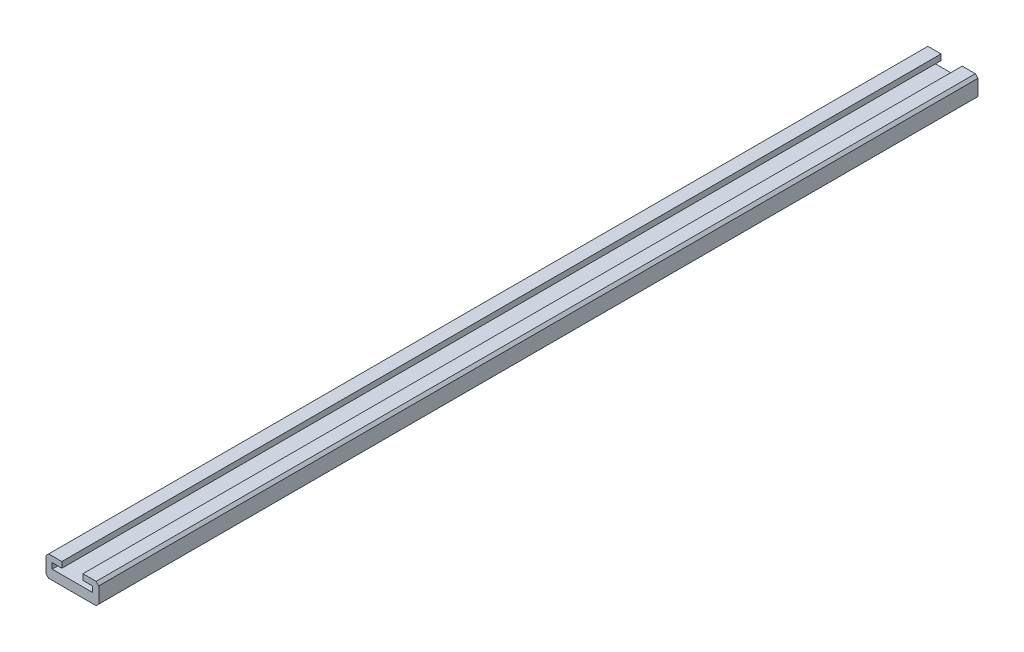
ISO-10303-21;
HEADER;
FILE_DESCRIPTION(('STEP AP214'),'2;1');
FILE_NAME('part.step','',(''),(''),'','','');
FILE_SCHEMA(('AUTOMOTIVE_DESIGN { 1 0 10303 214 1 1 1 1 }'));
ENDSEC;
DATA;
#1=APPLICATION_CONTEXT('core data for automotive mechanical design processes');
#2=APPLICATION_PROTOCOL_DEFINITION('international standard','automotive_design',2000,#1);
#3=PRODUCT_CONTEXT('',#1,'mechanical');
#4=PRODUCT('Part','Part','',(#3));
#5=PRODUCT_RELATED_PRODUCT_CATEGORY('part','',(#4));
#6=PRODUCT_DEFINITION_FORMATION('','',#4);
#7=PRODUCT_DEFINITION_CONTEXT('part definition',#1,'design');
#8=PRODUCT_DEFINITION('design','',#6,#7);
#9=PRODUCT_DEFINITION_SHAPE('','',#8);
#10=(LENGTH_UNIT() NAMED_UNIT(*) SI_UNIT(.MILLI.,.METRE.));
#11=(NAMED_UNIT(*) PLANE_ANGLE_UNIT() SI_UNIT($,.RADIAN.));
#12=(NAMED_UNIT(*) SI_UNIT($,.STERADIAN.) SOLID_ANGLE_UNIT());
#13=UNCERTAINTY_MEASURE_WITH_UNIT(LENGTH_MEASURE(1.E-05),#10,'distance_accuracy_value','');
#14=(GEOMETRIC_REPRESENTATION_CONTEXT(3) GLOBAL_UNCERTAINTY_ASSIGNED_CONTEXT((#13)) GLOBAL_UNIT_ASSIGNED_CONTEXT((#10,
#11,#12)) REPRESENTATION_CONTEXT('',''));
#15=CARTESIAN_POINT('',(0.,0.,0.));
#16=DIRECTION('',(0.,0.,1.));
#17=DIRECTION('',(1.,0.,0.));
#18=AXIS2_PLACEMENT_3D('',#15,#16,#17);
#19=CARTESIAN_POINT('',(-15.,0.,500.));
#20=DIRECTION('',(1.,0.,0.));
#21=DIRECTION('',(0.,0.,-1.));
#22=AXIS2_PLACEMENT_3D('',#19,#20,#21);
#23=PLANE('',#22);
#24=DIRECTION('',(0.,-1.,0.));
#25=VECTOR('',#24,1.);
#26=CARTESIAN_POINT('',(-15.,0.,0.));
#27=LINE('',#26,#25);
#28=CARTESIAN_POINT('',(-15.,10.5,0.));
#29=VERTEX_POINT('',#28);
#30=CARTESIAN_POINT('',(-15.,1.5,0.));
#31=VERTEX_POINT('',#30);
#32=EDGE_CURVE('E259',#29,#31,#27,.T.);
#33=ORIENTED_EDGE('',*,*,#32,.T.);
#34=DIRECTION('',(0.,0.,1.));
#35=VECTOR('',#34,1.);
#36=CARTESIAN_POINT('',(-15.,1.5,500.));
#37=LINE('',#36,#35);
#38=CARTESIAN_POINT('',(-15.,1.5,500.));
#39=VERTEX_POINT('',#38);
#40=EDGE_CURVE('E9',#31,#39,#37,.T.);
#41=ORIENTED_EDGE('',*,*,#40,.T.);
#42=DIRECTION('',(0.,-1.,0.));
#43=VECTOR('',#42,1.);
#44=CARTESIAN_POINT('',(-15.,0.,500.));
#45=LINE('',#44,#43);
#46=CARTESIAN_POINT('',(-15.,10.5,500.));
#47=VERTEX_POINT('',#46);
#48=EDGE_CURVE('E173',#47,#39,#45,.T.);
#49=ORIENTED_EDGE('',*,*,#48,.F.);
#50=DIRECTION('',(0.,0.,-1.));
#51=VECTOR('',#50,1.);
#52=CARTESIAN_POINT('',(-15.,10.5,500.));
#53=LINE('',#52,#51);
#54=EDGE_CURVE('E148',#47,#29,#53,.T.);
#55=ORIENTED_EDGE('',*,*,#54,.T.);
#56=EDGE_LOOP('',(#33,#41,#49,#55));
#57=FACE_BOUND('',#56,.T.);
#58=ADVANCED_FACE('F14',(#57),#23,.F.);
#59=CARTESIAN_POINT('',(-15.,0.,500.));
#60=DIRECTION('',(0.,1.,0.));
#61=DIRECTION('',(0.,0.,1.));
#62=AXIS2_PLACEMENT_3D('',#59,#60,#61);
#63=PLANE('',#62);
#64=DIRECTION('',(1.,0.,0.));
#65=VECTOR('',#64,1.);
#66=CARTESIAN_POINT('',(-15.,0.,0.));
#67=LINE('',#66,#65);
#68=CARTESIAN_POINT('',(-13.5,0.,0.));
#69=VERTEX_POINT('',#68);
#70=CARTESIAN_POINT('',(13.5,0.,0.));
#71=VERTEX_POINT('',#70);
#72=EDGE_CURVE('E256',#69,#71,#67,.T.);
#73=ORIENTED_EDGE('',*,*,#72,.T.);
#74=DIRECTION('',(0.,0.,1.));
#75=VECTOR('',#74,1.);
#76=CARTESIAN_POINT('',(13.5,0.,500.));
#77=LINE('',#76,#75);
#78=CARTESIAN_POINT('',(13.5,0.,500.));
#79=VERTEX_POINT('',#78);
#80=EDGE_CURVE('E34',#71,#79,#77,.T.);
#81=ORIENTED_EDGE('',*,*,#80,.T.);
#82=DIRECTION('',(1.,0.,0.));
#83=VECTOR('',#82,1.);
#84=CARTESIAN_POINT('',(-15.,0.,500.));
#85=LINE('',#84,#83);
#86=CARTESIAN_POINT('',(-13.5,0.,500.));
#87=VERTEX_POINT('',#86);
#88=EDGE_CURVE('E175',#87,#79,#85,.T.);
#89=ORIENTED_EDGE('',*,*,#88,.F.);
#90=DIRECTION('',(0.,0.,-1.));
#91=VECTOR('',#90,1.);
#92=CARTESIAN_POINT('',(-13.5,0.,500.));
#93=LINE('',#92,#91);
#94=EDGE_CURVE('E239',#87,#69,#93,.T.);
#95=ORIENTED_EDGE('',*,*,#94,.T.);
#96=EDGE_LOOP('',(#73,#81,#89,#95));
#97=FACE_BOUND('',#96,.T.);
#98=ADVANCED_FACE('F257',(#97),#63,.F.);
#99=CARTESIAN_POINT('',(15.,0.,500.));
#100=DIRECTION('',(-1.,0.,0.));
#101=DIRECTION('',(0.,0.,1.));
#102=AXIS2_PLACEMENT_3D('',#99,#100,#101);
#103=PLANE('',#102);
#104=DIRECTION('',(0.,1.,0.));
#105=VECTOR('',#104,1.);
#106=CARTESIAN_POINT('',(15.,0.,500.));
#107=LINE('',#106,#105);
#108=CARTESIAN_POINT('',(15.,1.5,500.));
#109=VERTEX_POINT('',#108);
#110=CARTESIAN_POINT('',(15.,10.5,500.));
#111=VERTEX_POINT('',#110);
#112=EDGE_CURVE('E177',#109,#111,#107,.T.);
#113=ORIENTED_EDGE('',*,*,#112,.F.);
#114=DIRECTION('',(0.,0.,-1.));
#115=VECTOR('',#114,1.);
#116=CARTESIAN_POINT('',(15.,1.5,500.));
#117=LINE('',#116,#115);
#118=CARTESIAN_POINT('',(15.,1.5,0.));
#119=VERTEX_POINT('',#118);
#120=EDGE_CURVE('E232',#109,#119,#117,.T.);
#121=ORIENTED_EDGE('',*,*,#120,.T.);
#122=DIRECTION('',(0.,1.,0.));
#123=VECTOR('',#122,1.);
#124=CARTESIAN_POINT('',(15.,0.,0.));
#125=LINE('',#124,#123);
#126=CARTESIAN_POINT('',(15.,10.5,0.));
#127=VERTEX_POINT('',#126);
#128=EDGE_CURVE('E141',#119,#127,#125,.T.);
#129=ORIENTED_EDGE('',*,*,#128,.T.);
#130=DIRECTION('',(0.,0.,1.));
#131=VECTOR('',#130,1.);
#132=CARTESIAN_POINT('',(15.,10.5,500.));
#133=LINE('',#132,#131);
#134=EDGE_CURVE('E229',#127,#111,#133,.T.);
#135=ORIENTED_EDGE('',*,*,#134,.T.);
#136=EDGE_LOOP('',(#113,#121,#129,#135));
#137=FACE_BOUND('',#136,.T.);
#138=ADVANCED_FACE('F251',(#137),#103,.F.);
#139=CARTESIAN_POINT('',(6.,12.,500.));
#140=DIRECTION('',(0.,-1.,0.));
#141=DIRECTION('',(0.,0.,-1.));
#142=AXIS2_PLACEMENT_3D('',#139,#140,#141);
#143=PLANE('',#142);
#144=DIRECTION('',(-1.,0.,0.));
#145=VECTOR('',#144,1.);
#146=CARTESIAN_POINT('',(6.,12.,500.));
#147=LINE('',#146,#145);
#148=CARTESIAN_POINT('',(13.5,12.,500.));
#149=VERTEX_POINT('',#148);
#150=CARTESIAN_POINT('',(6.,12.,500.));
#151=VERTEX_POINT('',#150);
#152=EDGE_CURVE('E179',#149,#151,#147,.T.);
#153=ORIENTED_EDGE('',*,*,#152,.F.);
#154=DIRECTION('',(0.,0.,-1.));
#155=VECTOR('',#154,1.);
#156=CARTESIAN_POINT('',(13.5,12.,500.));
#157=LINE('',#156,#155);
#158=CARTESIAN_POINT('',(13.5,12.,0.));
#159=VERTEX_POINT('',#158);
#160=EDGE_CURVE('E136',#149,#159,#157,.T.);
#161=ORIENTED_EDGE('',*,*,#160,.T.);
#162=DIRECTION('',(-1.,0.,0.));
#163=VECTOR('',#162,1.);
#164=CARTESIAN_POINT('',(6.,12.,0.));
#165=LINE('',#164,#163);
#166=CARTESIAN_POINT('',(6.,12.,0.));
#167=VERTEX_POINT('',#166);
#168=EDGE_CURVE('E129',#159,#167,#165,.T.);
#169=ORIENTED_EDGE('',*,*,#168,.T.);
#170=DIRECTION('',(0.,0.,-1.));
#171=VECTOR('',#170,1.);
#172=CARTESIAN_POINT('',(6.,12.,500.));
#173=LINE('',#172,#171);
#174=EDGE_CURVE('E133',#151,#167,#173,.T.);
#175=ORIENTED_EDGE('',*,*,#174,.F.);
#176=EDGE_LOOP('',(#153,#161,#169,#175));
#177=FACE_BOUND('',#176,.T.);
#178=ADVANCED_FACE('F132',(#177),#143,.F.);
#179=CARTESIAN_POINT('',(6.,8.7,500.));
#180=DIRECTION('',(1.,0.,0.));
#181=DIRECTION('',(0.,0.,-1.));
#182=AXIS2_PLACEMENT_3D('',#179,#180,#181);
#183=PLANE('',#182);
#184=DIRECTION('',(0.,-1.,0.));
#185=VECTOR('',#184,1.);
#186=CARTESIAN_POINT('',(6.,8.7,0.));
#187=LINE('',#186,#185);
#188=CARTESIAN_POINT('',(6.,8.7,0.));
#189=VERTEX_POINT('',#188);
#190=EDGE_CURVE('E140',#167,#189,#187,.T.);
#191=ORIENTED_EDGE('',*,*,#190,.T.);
#192=DIRECTION('',(0.,0.,-1.));
#193=VECTOR('',#192,1.);
#194=CARTESIAN_POINT('',(6.,8.7,500.));
#195=LINE('',#194,#193);
#196=CARTESIAN_POINT('',(6.,8.7,500.));
#197=VERTEX_POINT('',#196);
#198=EDGE_CURVE('E149',#197,#189,#195,.T.);
#199=ORIENTED_EDGE('',*,*,#198,.F.);
#200=DIRECTION('',(0.,-1.,0.));
#201=VECTOR('',#200,1.);
#202=CARTESIAN_POINT('',(6.,8.7,500.));
#203=LINE('',#202,#201);
#204=EDGE_CURVE('E147',#151,#197,#203,.T.);
#205=ORIENTED_EDGE('',*,*,#204,.F.);
#206=ORIENTED_EDGE('',*,*,#174,.T.);
#207=EDGE_LOOP('',(#191,#199,#205,#206));
#208=FACE_BOUND('',#207,.T.);
#209=ADVANCED_FACE('F144',(#208),#183,.F.);
#210=CARTESIAN_POINT('',(6.,8.7,500.));
#211=DIRECTION('',(0.,1.,0.));
#212=DIRECTION('',(0.,0.,1.));
#213=AXIS2_PLACEMENT_3D('',#210,#211,#212);
#214=PLANE('',#213);
#215=DIRECTION('',(1.,0.,0.));
#216=VECTOR('',#215,1.);
#217=CARTESIAN_POINT('',(6.,8.7,0.));
#218=LINE('',#217,#216);
#219=CARTESIAN_POINT('',(11.5,8.7,0.));
#220=VERTEX_POINT('',#219);
#221=EDGE_CURVE('E155',#189,#220,#218,.T.);
#222=ORIENTED_EDGE('',*,*,#221,.T.);
#223=DIRECTION('',(0.,0.,-1.));
#224=VECTOR('',#223,1.);
#225=CARTESIAN_POINT('',(11.5,8.7,500.));
#226=LINE('',#225,#224);
#227=CARTESIAN_POINT('',(11.5,8.7,500.));
#228=VERTEX_POINT('',#227);
#229=EDGE_CURVE('E212',#228,#220,#226,.T.);
#230=ORIENTED_EDGE('',*,*,#229,.F.);
#231=DIRECTION('',(1.,0.,0.));
#232=VECTOR('',#231,1.);
#233=CARTESIAN_POINT('',(6.,8.7,500.));
#234=LINE('',#233,#232);
#235=EDGE_CURVE('E182',#197,#228,#234,.T.);
#236=ORIENTED_EDGE('',*,*,#235,.F.);
#237=ORIENTED_EDGE('',*,*,#198,.T.);
#238=EDGE_LOOP('',(#222,#230,#236,#237));
#239=FACE_BOUND('',#238,.T.);
#240=ADVANCED_FACE('F302',(#239),#214,.F.);
#241=CARTESIAN_POINT('',(11.5,5.5,500.));
#242=DIRECTION('',(1.,0.,0.));
#243=DIRECTION('',(0.,0.,-1.));
#244=AXIS2_PLACEMENT_3D('',#241,#242,#243);
#245=PLANE('',#244);
#246=DIRECTION('',(0.,-1.,0.));
#247=VECTOR('',#246,1.);
#248=CARTESIAN_POINT('',(11.5,5.5,0.));
#249=LINE('',#248,#247);
#250=CARTESIAN_POINT('',(11.5,5.5,0.));
#251=VERTEX_POINT('',#250);
#252=EDGE_CURVE('E157',#220,#251,#249,.T.);
#253=ORIENTED_EDGE('',*,*,#252,.T.);
#254=DIRECTION('',(0.,0.,-1.));
#255=VECTOR('',#254,1.);
#256=CARTESIAN_POINT('',(11.5,5.5,500.));
#257=LINE('',#256,#255);
#258=CARTESIAN_POINT('',(11.5,5.5,500.));
#259=VERTEX_POINT('',#258);
#260=EDGE_CURVE('E209',#259,#251,#257,.T.);
#261=ORIENTED_EDGE('',*,*,#260,.F.);
#262=DIRECTION('',(0.,-1.,0.));
#263=VECTOR('',#262,1.);
#264=CARTESIAN_POINT('',(11.5,5.5,500.));
#265=LINE('',#264,#263);
#266=EDGE_CURVE('E184',#228,#259,#265,.T.);
#267=ORIENTED_EDGE('',*,*,#266,.F.);
#268=ORIENTED_EDGE('',*,*,#229,.T.);
#269=EDGE_LOOP('',(#253,#261,#267,#268));
#270=FACE_BOUND('',#269,.T.);
#271=ADVANCED_FACE('F297',(#270),#245,.F.);
#272=CARTESIAN_POINT('',(-11.5,5.5,500.));
#273=DIRECTION('',(0.,-1.,0.));
#274=DIRECTION('',(0.,0.,-1.));
#275=AXIS2_PLACEMENT_3D('',#272,#273,#274);
#276=PLANE('',#275);
#277=DIRECTION('',(-1.,0.,0.));
#278=VECTOR('',#277,1.);
#279=CARTESIAN_POINT('',(-11.5,5.5,0.));
#280=LINE('',#279,#278);
#281=CARTESIAN_POINT('',(-11.5,5.5,0.));
#282=VERTEX_POINT('',#281);
#283=EDGE_CURVE('E162',#251,#282,#280,.T.);
#284=ORIENTED_EDGE('',*,*,#283,.T.);
#285=DIRECTION('',(0.,0.,-1.));
#286=VECTOR('',#285,1.);
#287=CARTESIAN_POINT('',(-11.5,5.5,500.));
#288=LINE('',#287,#286);
#289=CARTESIAN_POINT('',(-11.5,5.5,500.));
#290=VERTEX_POINT('',#289);
#291=EDGE_CURVE('E206',#290,#282,#288,.T.);
#292=ORIENTED_EDGE('',*,*,#291,.F.);
#293=DIRECTION('',(-1.,0.,0.));
#294=VECTOR('',#293,1.);
#295=CARTESIAN_POINT('',(-11.5,5.5,500.));
#296=LINE('',#295,#294);
#297=EDGE_CURVE('E186',#259,#290,#296,.T.);
#298=ORIENTED_EDGE('',*,*,#297,.F.);
#299=ORIENTED_EDGE('',*,*,#260,.T.);
#300=EDGE_LOOP('',(#284,#292,#298,#299));
#301=FACE_BOUND('',#300,.T.);
#302=ADVANCED_FACE('F294',(#301),#276,.F.);
#303=CARTESIAN_POINT('',(-11.5,5.5,500.));
#304=DIRECTION('',(-1.,0.,0.));
#305=DIRECTION('',(0.,0.,1.));
#306=AXIS2_PLACEMENT_3D('',#303,#304,#305);
#307=PLANE('',#306);
#308=DIRECTION('',(0.,1.,0.));
#309=VECTOR('',#308,1.);
#310=CARTESIAN_POINT('',(-11.5,5.5,0.));
#311=LINE('',#310,#309);
#312=CARTESIAN_POINT('',(-11.5,8.7,0.));
#313=VERTEX_POINT('',#312);
#314=EDGE_CURVE('E164',#282,#313,#311,.T.);
#315=ORIENTED_EDGE('',*,*,#314,.T.);
#316=DIRECTION('',(0.,0.,-1.));
#317=VECTOR('',#316,1.);
#318=CARTESIAN_POINT('',(-11.5,8.7,500.));
#319=LINE('',#318,#317);
#320=CARTESIAN_POINT('',(-11.5,8.7,500.));
#321=VERTEX_POINT('',#320);
#322=EDGE_CURVE('E203',#321,#313,#319,.T.);
#323=ORIENTED_EDGE('',*,*,#322,.F.);
#324=DIRECTION('',(0.,1.,0.));
#325=VECTOR('',#324,1.);
#326=CARTESIAN_POINT('',(-11.5,5.5,500.));
#327=LINE('',#326,#325);
#328=EDGE_CURVE('E188',#290,#321,#327,.T.);
#329=ORIENTED_EDGE('',*,*,#328,.F.);
#330=ORIENTED_EDGE('',*,*,#291,.T.);
#331=EDGE_LOOP('',(#315,#323,#329,#330));
#332=FACE_BOUND('',#331,.T.);
#333=ADVANCED_FACE('F290',(#332),#307,.F.);
#334=CARTESIAN_POINT('',(-11.5,8.7,500.));
#335=DIRECTION('',(0.,1.,0.));
#336=DIRECTION('',(0.,0.,1.));
#337=AXIS2_PLACEMENT_3D('',#334,#335,#336);
#338=PLANE('',#337);
#339=DIRECTION('',(1.,0.,0.));
#340=VECTOR('',#339,1.);
#341=CARTESIAN_POINT('',(-11.5,8.7,0.));
#342=LINE('',#341,#340);
#343=CARTESIAN_POINT('',(-6.,8.7,0.));
#344=VERTEX_POINT('',#343);
#345=EDGE_CURVE('E166',#313,#344,#342,.T.);
#346=ORIENTED_EDGE('',*,*,#345,.T.);
#347=DIRECTION('',(0.,0.,-1.));
#348=VECTOR('',#347,1.);
#349=CARTESIAN_POINT('',(-6.,8.7,500.));
#350=LINE('',#349,#348);
#351=CARTESIAN_POINT('',(-6.,8.7,500.));
#352=VERTEX_POINT('',#351);
#353=EDGE_CURVE('E200',#352,#344,#350,.T.);
#354=ORIENTED_EDGE('',*,*,#353,.F.);
#355=DIRECTION('',(1.,0.,0.));
#356=VECTOR('',#355,1.);
#357=CARTESIAN_POINT('',(-11.5,8.7,500.));
#358=LINE('',#357,#356);
#359=EDGE_CURVE('E190',#321,#352,#358,.T.);
#360=ORIENTED_EDGE('',*,*,#359,.F.);
#361=ORIENTED_EDGE('',*,*,#322,.T.);
#362=EDGE_LOOP('',(#346,#354,#360,#361));
#363=FACE_BOUND('',#362,.T.);
#364=ADVANCED_FACE('F285',(#363),#338,.F.);
#365=CARTESIAN_POINT('',(-6.,8.7,500.));
#366=DIRECTION('',(-1.,0.,0.));
#367=DIRECTION('',(0.,0.,1.));
#368=AXIS2_PLACEMENT_3D('',#365,#366,#367);
#369=PLANE('',#368);
#370=DIRECTION('',(0.,1.,0.));
#371=VECTOR('',#370,1.);
#372=CARTESIAN_POINT('',(-6.,8.7,0.));
#373=LINE('',#372,#371);
#374=CARTESIAN_POINT('',(-6.,12.,0.));
#375=VERTEX_POINT('',#374);
#376=EDGE_CURVE('E168',#344,#375,#373,.T.);
#377=ORIENTED_EDGE('',*,*,#376,.T.);
#378=DIRECTION('',(0.,0.,-1.));
#379=VECTOR('',#378,1.);
#380=CARTESIAN_POINT('',(-6.,12.,500.));
#381=LINE('',#380,#379);
#382=CARTESIAN_POINT('',(-6.,12.,500.));
#383=VERTEX_POINT('',#382);
#384=EDGE_CURVE('E197',#383,#375,#381,.T.);
#385=ORIENTED_EDGE('',*,*,#384,.F.);
#386=DIRECTION('',(0.,1.,0.));
#387=VECTOR('',#386,1.);
#388=CARTESIAN_POINT('',(-6.,8.7,500.));
#389=LINE('',#388,#387);
#390=EDGE_CURVE('E192',#352,#383,#389,.T.);
#391=ORIENTED_EDGE('',*,*,#390,.F.);
#392=ORIENTED_EDGE('',*,*,#353,.T.);
#393=EDGE_LOOP('',(#377,#385,#391,#392));
#394=FACE_BOUND('',#393,.T.);
#395=ADVANCED_FACE('F279',(#394),#369,.F.);
#396=CARTESIAN_POINT('',(-15.,12.,500.));
#397=DIRECTION('',(0.,-1.,0.));
#398=DIRECTION('',(0.,0.,-1.));
#399=AXIS2_PLACEMENT_3D('',#396,#397,#398);
#400=PLANE('',#399);
#401=DIRECTION('',(-1.,0.,0.));
#402=VECTOR('',#401,1.);
#403=CARTESIAN_POINT('',(-15.,12.,0.));
#404=LINE('',#403,#402);
#405=CARTESIAN_POINT('',(-13.5,12.,0.));
#406=VERTEX_POINT('',#405);
#407=EDGE_CURVE('E170',#375,#406,#404,.T.);
#408=ORIENTED_EDGE('',*,*,#407,.T.);
#409=DIRECTION('',(0.,0.,1.));
#410=VECTOR('',#409,1.);
#411=CARTESIAN_POINT('',(-13.5,12.,500.));
#412=LINE('',#411,#410);
#413=CARTESIAN_POINT('',(-13.5,12.,500.));
#414=VERTEX_POINT('',#413);
#415=EDGE_CURVE('E222',#406,#414,#412,.T.);
#416=ORIENTED_EDGE('',*,*,#415,.T.);
#417=DIRECTION('',(-1.,0.,0.));
#418=VECTOR('',#417,1.);
#419=CARTESIAN_POINT('',(-15.,12.,500.));
#420=LINE('',#419,#418);
#421=EDGE_CURVE('E194',#383,#414,#420,.T.);
#422=ORIENTED_EDGE('',*,*,#421,.F.);
#423=ORIENTED_EDGE('',*,*,#384,.T.);
#424=EDGE_LOOP('',(#408,#416,#422,#423));
#425=FACE_BOUND('',#424,.T.);
#426=ADVANCED_FACE('F274',(#425),#400,.F.);
#427=CARTESIAN_POINT('',(-15.,12.,500.));
#428=DIRECTION('',(0.,0.,-1.));
#429=DIRECTION('',(-1.,0.,0.));
#430=AXIS2_PLACEMENT_3D('',#427,#428,#429);
#431=PLANE('',#430);
#432=ORIENTED_EDGE('',*,*,#88,.T.);
#433=DIRECTION('',(-0.707106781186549,-0.707106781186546,0.));
#434=VECTOR('',#433,1.);
#435=CARTESIAN_POINT('',(15.,1.5,500.));
#436=LINE('',#435,#434);
#437=EDGE_CURVE('E21',#79,#109,#436,.F.);
#438=ORIENTED_EDGE('',*,*,#437,.T.);
#439=ORIENTED_EDGE('',*,*,#112,.T.);
#440=DIRECTION('',(0.707106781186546,-0.707106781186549,0.));
#441=VECTOR('',#440,1.);
#442=CARTESIAN_POINT('',(13.5,12.,500.));
#443=LINE('',#442,#441);
#444=EDGE_CURVE('E224',#111,#149,#443,.F.);
#445=ORIENTED_EDGE('',*,*,#444,.T.);
#446=ORIENTED_EDGE('',*,*,#152,.T.);
#447=ORIENTED_EDGE('',*,*,#204,.T.);
#448=ORIENTED_EDGE('',*,*,#235,.T.);
#449=ORIENTED_EDGE('',*,*,#266,.T.);
#450=ORIENTED_EDGE('',*,*,#297,.T.);
#451=ORIENTED_EDGE('',*,*,#328,.T.);
#452=ORIENTED_EDGE('',*,*,#359,.T.);
#453=ORIENTED_EDGE('',*,*,#390,.T.);
#454=ORIENTED_EDGE('',*,*,#421,.T.);
#455=DIRECTION('',(0.707106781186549,0.707106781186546,0.));
#456=VECTOR('',#455,1.);
#457=CARTESIAN_POINT('',(-15.,10.5,500.));
#458=LINE('',#457,#456);
#459=EDGE_CURVE('E226',#414,#47,#458,.F.);
#460=ORIENTED_EDGE('',*,*,#459,.T.);
#461=ORIENTED_EDGE('',*,*,#48,.T.);
#462=DIRECTION('',(-0.707106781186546,0.707106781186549,0.));
#463=VECTOR('',#462,1.);
#464=CARTESIAN_POINT('',(-13.5,0.,500.));
#465=LINE('',#464,#463);
#466=EDGE_CURVE('E243',#39,#87,#465,.F.);
#467=ORIENTED_EDGE('',*,*,#466,.T.);
#468=EDGE_LOOP('',(#432,#438,#439,#445,#446,#447,#448,#449,#450,#451,#452,#453,#454,#460,#461,#467));
#469=FACE_BOUND('',#468,.T.);
#470=ADVANCED_FACE('F247',(#469),#431,.F.);
#471=CARTESIAN_POINT('',(-15.,12.,0.));
#472=DIRECTION('',(0.,0.,-1.));
#473=DIRECTION('',(-1.,0.,0.));
#474=AXIS2_PLACEMENT_3D('',#471,#472,#473);
#475=PLANE('',#474);
#476=ORIENTED_EDGE('',*,*,#128,.F.);
#477=DIRECTION('',(0.707106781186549,0.707106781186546,0.));
#478=VECTOR('',#477,1.);
#479=CARTESIAN_POINT('',(5.25,-8.25,0.));
#480=LINE('',#479,#478);
#481=EDGE_CURVE('E237',#119,#71,#480,.F.);
#482=ORIENTED_EDGE('',*,*,#481,.T.);
#483=ORIENTED_EDGE('',*,*,#72,.F.);
#484=DIRECTION('',(0.707106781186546,-0.707106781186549,0.));
#485=VECTOR('',#484,1.);
#486=CARTESIAN_POINT('',(-20.25,6.75,0.));
#487=LINE('',#486,#485);
#488=EDGE_CURVE('E235',#69,#31,#487,.F.);
#489=ORIENTED_EDGE('',*,*,#488,.T.);
#490=ORIENTED_EDGE('',*,*,#32,.F.);
#491=DIRECTION('',(-0.707106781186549,-0.707106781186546,0.));
#492=VECTOR('',#491,1.);
#493=CARTESIAN_POINT('',(-14.25,11.25,0.));
#494=LINE('',#493,#492);
#495=EDGE_CURVE('E220',#29,#406,#494,.F.);
#496=ORIENTED_EDGE('',*,*,#495,.T.);
#497=ORIENTED_EDGE('',*,*,#407,.F.);
#498=ORIENTED_EDGE('',*,*,#376,.F.);
#499=ORIENTED_EDGE('',*,*,#345,.F.);
#500=ORIENTED_EDGE('',*,*,#314,.F.);
#501=ORIENTED_EDGE('',*,*,#283,.F.);
#502=ORIENTED_EDGE('',*,*,#252,.F.);
#503=ORIENTED_EDGE('',*,*,#221,.F.);
#504=ORIENTED_EDGE('',*,*,#190,.F.);
#505=ORIENTED_EDGE('',*,*,#168,.F.);
#506=DIRECTION('',(-0.707106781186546,0.707106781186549,0.));
#507=VECTOR('',#506,1.);
#508=CARTESIAN_POINT('',(-0.749999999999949,26.25,0.));
#509=LINE('',#508,#507);
#510=EDGE_CURVE('E218',#159,#127,#509,.F.);
#511=ORIENTED_EDGE('',*,*,#510,.T.);
#512=EDGE_LOOP('',(#476,#482,#483,#489,#490,#496,#497,#498,#499,#500,#501,#502,#503,#504,#505,#511));
#513=FACE_BOUND('',#512,.T.);
#514=ADVANCED_FACE('F153',(#513),#475,.T.);
#515=CARTESIAN_POINT('',(-15.,10.5,500.));
#516=DIRECTION('',(0.707106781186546,-0.707106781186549,0.));
#517=DIRECTION('',(0.707106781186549,0.707106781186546,0.));
#518=AXIS2_PLACEMENT_3D('',#515,#516,#517);
#519=PLANE('',#518);
#520=ORIENTED_EDGE('',*,*,#459,.F.);
#521=ORIENTED_EDGE('',*,*,#415,.F.);
#522=ORIENTED_EDGE('',*,*,#495,.F.);
#523=ORIENTED_EDGE('',*,*,#54,.F.);
#524=EDGE_LOOP('',(#520,#521,#522,#523));
#525=FACE_BOUND('',#524,.T.);
#526=ADVANCED_FACE('F269',(#525),#519,.F.);
#527=CARTESIAN_POINT('',(13.5,12.,500.));
#528=DIRECTION('',(-0.707106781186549,-0.707106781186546,0.));
#529=DIRECTION('',(0.707106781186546,-0.707106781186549,0.));
#530=AXIS2_PLACEMENT_3D('',#527,#528,#529);
#531=PLANE('',#530);
#532=ORIENTED_EDGE('',*,*,#444,.F.);
#533=ORIENTED_EDGE('',*,*,#134,.F.);
#534=ORIENTED_EDGE('',*,*,#510,.F.);
#535=ORIENTED_EDGE('',*,*,#160,.F.);
#536=EDGE_LOOP('',(#532,#533,#534,#535));
#537=FACE_BOUND('',#536,.T.);
#538=ADVANCED_FACE('F304',(#537),#531,.F.);
#539=CARTESIAN_POINT('',(15.,1.5,500.));
#540=DIRECTION('',(-0.707106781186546,0.707106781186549,0.));
#541=DIRECTION('',(-0.707106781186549,-0.707106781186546,0.));
#542=AXIS2_PLACEMENT_3D('',#539,#540,#541);
#543=PLANE('',#542);
#544=ORIENTED_EDGE('',*,*,#437,.F.);
#545=ORIENTED_EDGE('',*,*,#80,.F.);
#546=ORIENTED_EDGE('',*,*,#481,.F.);
#547=ORIENTED_EDGE('',*,*,#120,.F.);
#548=EDGE_LOOP('',(#544,#545,#546,#547));
#549=FACE_BOUND('',#548,.T.);
#550=ADVANCED_FACE('F254',(#549),#543,.F.);
#551=CARTESIAN_POINT('',(-13.5,0.,500.));
#552=DIRECTION('',(0.707106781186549,0.707106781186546,0.));
#553=DIRECTION('',(-0.707106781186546,0.707106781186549,0.));
#554=AXIS2_PLACEMENT_3D('',#551,#552,#553);
#555=PLANE('',#554);
#556=ORIENTED_EDGE('',*,*,#466,.F.);
#557=ORIENTED_EDGE('',*,*,#40,.F.);
#558=ORIENTED_EDGE('',*,*,#488,.F.);
#559=ORIENTED_EDGE('',*,*,#94,.F.);
#560=EDGE_LOOP('',(#556,#557,#558,#559));
#561=FACE_BOUND('',#560,.T.);
#562=ADVANCED_FACE('F266',(#561),#555,.F.);
#563=CLOSED_SHELL('',(#58,#98,#138,#178,#209,#240,#271,#302,#333,#364,#395,#426,#470,#514,#526,
#538,#550,#562));
#564=MANIFOLD_SOLID_BREP('B1',#563);
#565=ADVANCED_BREP_SHAPE_REPRESENTATION('',(#18,#564),#14);
#566=SHAPE_DEFINITION_REPRESENTATION(#9,#565);
ENDSEC;
END-ISO-10303-21;
